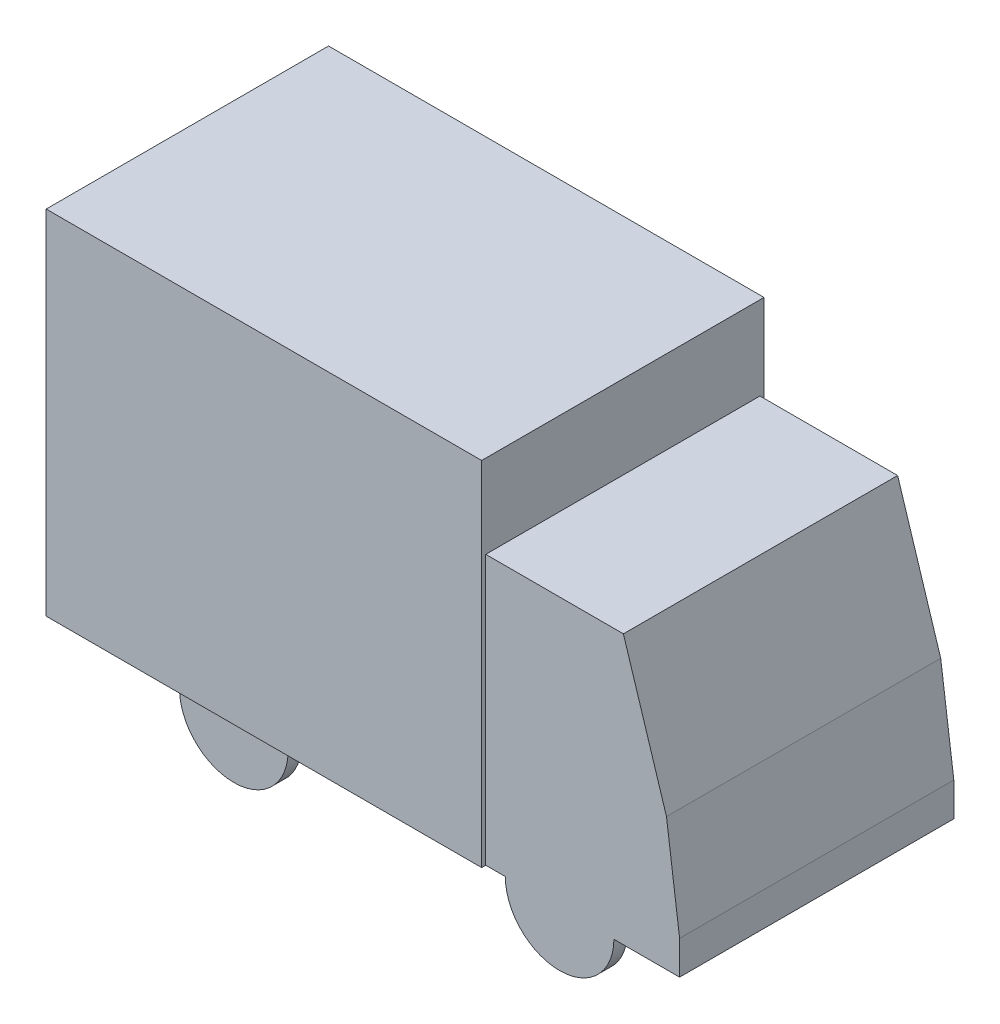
from build123d import *

# Parameters (mm, degrees)
ESQUISSE1_R          = 500
BOSS_EXTRU_1_DEPTH   = 62.5
BOSS_EXTRU_1_2_DEPTH = 62.5
BOSS_EXTRU_3_REACH   = 3756.185
ESQUISSE4_W          = 4009.663016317
ESQUISSE4_H          = 3246.602875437
BOSS_EXTRU_4_DEPTH   = 1300


with BuildPart() as part:
    # Esquisse1 → Boss.-Extru.1 (new, symmetric)
    with BuildSketch(Plane.XY.offset(-1200)):
        Circle(ESQUISSE1_R)
    extrude(amount=BOSS_EXTRU_1_DEPTH, both=True)

    # Boss.-Extru.3: up to this face of the body (flat: up to its plane)
    boss_extru_3_end = Plane(part.part.faces().sort_by_distance((0, 0, -1262.5))[0])
    # Esquisse3 → Boss.-Extru.3 (add, up to the picked face)
    with BuildSketch(Plane.XY, mode=Mode.PRIVATE) as boss_extru_3_sk1:
        Polygon((587.402347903, 2479.161997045), (984.057183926, 1220.214039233), (1104.778220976, 310.128951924), (1104.778220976, 0), (-680.168541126, 0), (-680.168541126, 2479.161997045), align=None)
    boss_extru_3_tool1 = split(extrude(boss_extru_3_sk1.sketch, amount=-BOSS_EXTRU_3_REACH, mode=Mode.PRIVATE), bisect_by=boss_extru_3_end, keep=Keep.BOTH, mode=Mode.PRIVATE)
    add(boss_extru_3_tool1.solids().sort_by(Axis((128.404917, 1169.097185, 0), (0, 0, -1)))[0])



with BuildPart() as body_2:
    # Esquisse1 → Boss.-Extru.1 2 (new, symmetric)
    with BuildSketch(Plane.XY.offset(-1200)):
        with Locations((-3000, 0)):
            Circle(ESQUISSE1_R)
    extrude(amount=BOSS_EXTRU_1_2_DEPTH, both=True)


with BuildPart() as part_1:
    add(part.part)

    add(body_2.part)  # Boss.-Extru.4 merges body 2
    # Esquisse4 → Boss.-Extru.4 (add)
    with BuildSketch(Plane.XY):
        with Locations((-2685.000049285, 1623.301437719)):
            Rectangle(ESQUISSE4_W, ESQUISSE4_H)
    extrude(amount=-BOSS_EXTRU_4_DEPTH)

    # Sym_trie1: part across plane


with BuildPart() as part_2:
    add(part_1.part)
    add(part_1.part.mirror(Plane.XY))


solid = part_2.part
